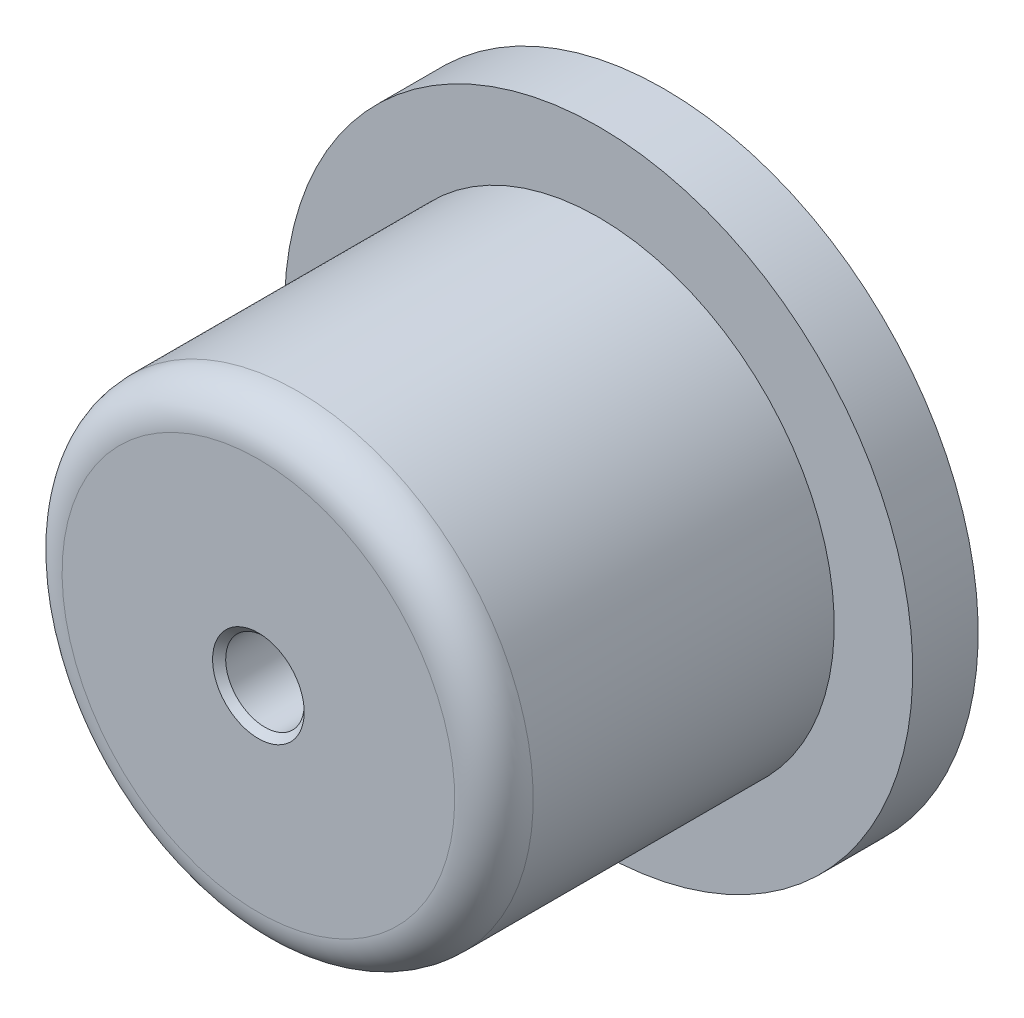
from build123d import *


with BuildPart() as part:
    # Sketch1 → Revolve1 (revolve)
    with BuildSketch(Plane(origin=(0, 0, 0), x_dir=(0, 0, -1), z_dir=(1, 0, 0))):
        with BuildLine():
            Line((0, 0), (0, 24))
            Line((0, 24), (-5, 24))
            Line((-5, 24), (-5, 18))
            Line((-5, 18), (-28, 18))
            ThreePointArc((-28, 18), (-30.121320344, 17.121320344), (-31, 15))
            Line((-31, 15), (-31, 3.5))
            Line((-31, 3.5), (-30.5, 3))
            Line((-30.5, 3), (-22, 3))
            Line((-22, 3), (-20.267949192, 0))
            Line((-20.267949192, 0), (0, 0))
        make_face()
    revolve(axis=Axis((0, 0, 0), (0, 0, 1)))


solid = part.part
